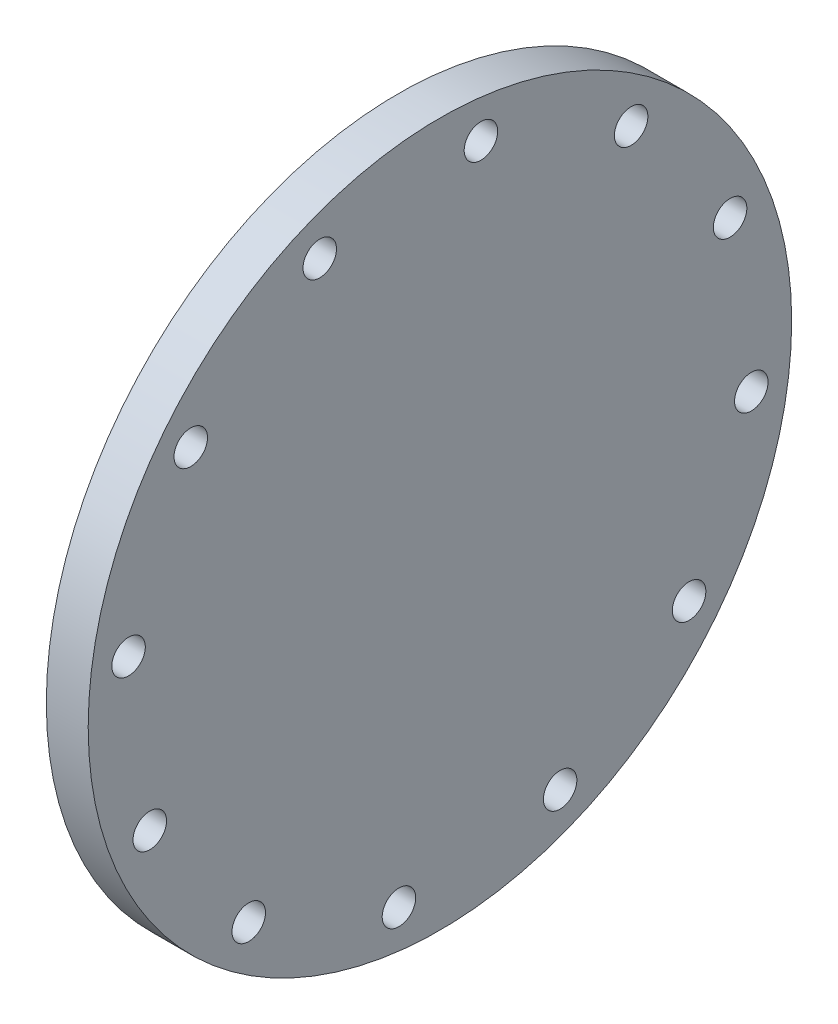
ISO-10303-21;
HEADER;
FILE_DESCRIPTION(('STEP AP214'),'2;1');
FILE_NAME('part.step','',(''),(''),'','','');
FILE_SCHEMA(('AUTOMOTIVE_DESIGN { 1 0 10303 214 1 1 1 1 }'));
ENDSEC;
DATA;
#1=APPLICATION_CONTEXT('core data for automotive mechanical design processes');
#2=APPLICATION_PROTOCOL_DEFINITION('international standard','automotive_design',2000,#1);
#3=PRODUCT_CONTEXT('',#1,'mechanical');
#4=PRODUCT('Part','Part','',(#3));
#5=PRODUCT_RELATED_PRODUCT_CATEGORY('part','',(#4));
#6=PRODUCT_DEFINITION_FORMATION('','',#4);
#7=PRODUCT_DEFINITION_CONTEXT('part definition',#1,'design');
#8=PRODUCT_DEFINITION('design','',#6,#7);
#9=PRODUCT_DEFINITION_SHAPE('','',#8);
#10=(LENGTH_UNIT() NAMED_UNIT(*) SI_UNIT(.MILLI.,.METRE.));
#11=(NAMED_UNIT(*) PLANE_ANGLE_UNIT() SI_UNIT($,.RADIAN.));
#12=(NAMED_UNIT(*) SI_UNIT($,.STERADIAN.) SOLID_ANGLE_UNIT());
#13=UNCERTAINTY_MEASURE_WITH_UNIT(LENGTH_MEASURE(1.E-05),#10,'distance_accuracy_value','');
#14=(GEOMETRIC_REPRESENTATION_CONTEXT(3) GLOBAL_UNCERTAINTY_ASSIGNED_CONTEXT((#13)) GLOBAL_UNIT_ASSIGNED_CONTEXT((#10,
#11,#12)) REPRESENTATION_CONTEXT('',''));
#15=CARTESIAN_POINT('',(0.,0.,0.));
#16=DIRECTION('',(0.,0.,1.));
#17=DIRECTION('',(1.,0.,0.));
#18=AXIS2_PLACEMENT_3D('',#15,#16,#17);
#19=CARTESIAN_POINT('',(0.,0.,0.));
#20=DIRECTION('',(-1.,0.,0.));
#21=DIRECTION('',(0.,0.,1.));
#22=AXIS2_PLACEMENT_3D('',#19,#20,#21);
#23=PLANE('',#22);
#24=CARTESIAN_POINT('',(0.,0.,0.));
#25=DIRECTION('',(-1.,0.,0.));
#26=DIRECTION('',(0.,0.,1.));
#27=AXIS2_PLACEMENT_3D('',#24,#25,#26);
#28=CIRCLE('',#27,206.375);
#29=CARTESIAN_POINT('',(0.,0.,206.375));
#30=VERTEX_POINT('',#29);
#31=EDGE_CURVE('E10',#30,#30,#28,.T.);
#32=ORIENTED_EDGE('',*,*,#31,.T.);
#33=EDGE_LOOP('',(#32));
#34=FACE_BOUND('',#33,.T.);
#35=ADVANCED_FACE('F30',(#34),#23,.T.);
#36=CARTESIAN_POINT('',(0.,0.,0.));
#37=DIRECTION('',(-1.,0.,0.));
#38=DIRECTION('',(0.,0.,1.));
#39=AXIS2_PLACEMENT_3D('',#36,#37,#38);
#40=CYLINDRICAL_SURFACE('',#39,206.375);
#41=CARTESIAN_POINT('',(1.5875,0.,0.));
#42=DIRECTION('',(-1.,0.,0.));
#43=DIRECTION('',(0.,0.,1.));
#44=AXIS2_PLACEMENT_3D('',#41,#42,#43);
#45=CIRCLE('',#44,206.375);
#46=CARTESIAN_POINT('',(1.5875,0.,206.375));
#47=VERTEX_POINT('',#46);
#48=EDGE_CURVE('E36',#47,#47,#45,.T.);
#49=ORIENTED_EDGE('',*,*,#48,.T.);
#50=EDGE_LOOP('',(#49));
#51=FACE_BOUND('',#50,.T.);
#52=ORIENTED_EDGE('',*,*,#31,.F.);
#53=EDGE_LOOP('',(#52));
#54=FACE_BOUND('',#53,.T.);
#55=ADVANCED_FACE('F162',(#51,#54),#40,.T.);
#56=CARTESIAN_POINT('',(1.5875,206.375,0.));
#57=DIRECTION('',(-1.,0.,0.));
#58=DIRECTION('',(0.,0.,1.));
#59=AXIS2_PLACEMENT_3D('',#56,#57,#58);
#60=PLANE('',#59);
#61=CARTESIAN_POINT('',(1.5875,236.087807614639,-31.0815495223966));
#62=DIRECTION('',(-1.,0.,0.));
#63=DIRECTION('',(0.,0.,1.));
#64=AXIS2_PLACEMENT_3D('',#61,#62,#63);
#65=CIRCLE('',#64,12.7);
#66=CARTESIAN_POINT('',(1.5875,236.087807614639,-18.3815495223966));
#67=VERTEX_POINT('',#66);
#68=EDGE_CURVE('E115',#67,#67,#65,.T.);
#69=ORIENTED_EDGE('',*,*,#68,.F.);
#70=EDGE_LOOP('',(#69));
#71=FACE_BOUND('',#70,.T.);
#72=CARTESIAN_POINT('',(1.5875,188.917264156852,-144.961315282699));
#73=DIRECTION('',(-1.,0.,0.));
#74=DIRECTION('',(0.,0.,1.));
#75=AXIS2_PLACEMENT_3D('',#72,#73,#74);
#76=CIRCLE('',#75,12.7);
#77=CARTESIAN_POINT('',(1.5875,188.917264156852,-132.261315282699));
#78=VERTEX_POINT('',#77);
#79=EDGE_CURVE('E109',#78,#78,#76,.T.);
#80=ORIENTED_EDGE('',*,*,#79,.F.);
#81=EDGE_LOOP('',(#80));
#82=FACE_BOUND('',#81,.T.);
#83=CARTESIAN_POINT('',(1.5875,91.1264923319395,-219.998813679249));
#84=DIRECTION('',(-1.,0.,0.));
#85=DIRECTION('',(0.,0.,1.));
#86=AXIS2_PLACEMENT_3D('',#83,#84,#85);
#87=CIRCLE('',#86,12.7);
#88=CARTESIAN_POINT('',(1.5875,91.1264923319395,-207.298813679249));
#89=VERTEX_POINT('',#88);
#90=EDGE_CURVE('E103',#89,#89,#87,.T.);
#91=ORIENTED_EDGE('',*,*,#90,.F.);
#92=EDGE_LOOP('',(#91));
#93=FACE_BOUND('',#92,.T.);
#94=CARTESIAN_POINT('',(1.5875,-31.0815495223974,-236.087807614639));
#95=DIRECTION('',(-1.,0.,0.));
#96=DIRECTION('',(0.,0.,1.));
#97=AXIS2_PLACEMENT_3D('',#94,#95,#96);
#98=CIRCLE('',#97,12.7);
#99=CARTESIAN_POINT('',(1.5875,-31.0815495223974,-223.387807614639));
#100=VERTEX_POINT('',#99);
#101=EDGE_CURVE('E97',#100,#100,#98,.T.);
#102=ORIENTED_EDGE('',*,*,#101,.F.);
#103=EDGE_LOOP('',(#102));
#104=FACE_BOUND('',#103,.T.);
#105=CARTESIAN_POINT('',(1.5875,-144.9613152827,-188.917264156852));
#106=DIRECTION('',(-1.,0.,0.));
#107=DIRECTION('',(0.,0.,1.));
#108=AXIS2_PLACEMENT_3D('',#105,#106,#107);
#109=CIRCLE('',#108,12.7);
#110=CARTESIAN_POINT('',(1.5875,-144.9613152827,-176.217264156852));
#111=VERTEX_POINT('',#110);
#112=EDGE_CURVE('E91',#111,#111,#109,.T.);
#113=ORIENTED_EDGE('',*,*,#112,.F.);
#114=EDGE_LOOP('',(#113));
#115=FACE_BOUND('',#114,.T.);
#116=CARTESIAN_POINT('',(1.5875,-219.998813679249,-91.1264923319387));
#117=DIRECTION('',(-1.,0.,0.));
#118=DIRECTION('',(0.,0.,1.));
#119=AXIS2_PLACEMENT_3D('',#116,#117,#118);
#120=CIRCLE('',#119,12.7);
#121=CARTESIAN_POINT('',(1.5875,-219.998813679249,-78.4264923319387));
#122=VERTEX_POINT('',#121);
#123=EDGE_CURVE('E85',#122,#122,#120,.T.);
#124=ORIENTED_EDGE('',*,*,#123,.F.);
#125=EDGE_LOOP('',(#124));
#126=FACE_BOUND('',#125,.T.);
#127=CARTESIAN_POINT('',(1.5875,-236.087807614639,31.0815495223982));
#128=DIRECTION('',(-1.,0.,0.));
#129=DIRECTION('',(0.,0.,1.));
#130=AXIS2_PLACEMENT_3D('',#127,#128,#129);
#131=CIRCLE('',#130,12.7);
#132=CARTESIAN_POINT('',(1.5875,-236.087807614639,43.7815495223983));
#133=VERTEX_POINT('',#132);
#134=EDGE_CURVE('E79',#133,#133,#131,.T.);
#135=ORIENTED_EDGE('',*,*,#134,.F.);
#136=EDGE_LOOP('',(#135));
#137=FACE_BOUND('',#136,.T.);
#138=CARTESIAN_POINT('',(1.5875,-188.917264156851,144.961315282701));
#139=DIRECTION('',(-1.,0.,0.));
#140=DIRECTION('',(0.,0.,1.));
#141=AXIS2_PLACEMENT_3D('',#138,#139,#140);
#142=CIRCLE('',#141,12.7);
#143=CARTESIAN_POINT('',(1.5875,-188.917264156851,157.661315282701));
#144=VERTEX_POINT('',#143);
#145=EDGE_CURVE('E73',#144,#144,#142,.T.);
#146=ORIENTED_EDGE('',*,*,#145,.F.);
#147=EDGE_LOOP('',(#146));
#148=FACE_BOUND('',#147,.T.);
#149=CARTESIAN_POINT('',(1.5875,-91.1264923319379,219.99881367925));
#150=DIRECTION('',(-1.,0.,0.));
#151=DIRECTION('',(0.,0.,1.));
#152=AXIS2_PLACEMENT_3D('',#149,#150,#151);
#153=CIRCLE('',#152,12.7);
#154=CARTESIAN_POINT('',(1.5875,-91.1264923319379,232.69881367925));
#155=VERTEX_POINT('',#154);
#156=EDGE_CURVE('E67',#155,#155,#153,.T.);
#157=ORIENTED_EDGE('',*,*,#156,.F.);
#158=EDGE_LOOP('',(#157));
#159=FACE_BOUND('',#158,.T.);
#160=CARTESIAN_POINT('',(1.5875,31.0815495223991,236.087807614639));
#161=DIRECTION('',(-1.,0.,0.));
#162=DIRECTION('',(0.,0.,1.));
#163=AXIS2_PLACEMENT_3D('',#160,#161,#162);
#164=CIRCLE('',#163,12.7);
#165=CARTESIAN_POINT('',(1.5875,31.0815495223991,248.787807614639));
#166=VERTEX_POINT('',#165);
#167=EDGE_CURVE('E61',#166,#166,#164,.T.);
#168=ORIENTED_EDGE('',*,*,#167,.F.);
#169=EDGE_LOOP('',(#168));
#170=FACE_BOUND('',#169,.T.);
#171=CARTESIAN_POINT('',(1.5875,144.961315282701,188.917264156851));
#172=DIRECTION('',(-1.,0.,0.));
#173=DIRECTION('',(0.,0.,1.));
#174=AXIS2_PLACEMENT_3D('',#171,#172,#173);
#175=CIRCLE('',#174,12.7);
#176=CARTESIAN_POINT('',(1.5875,144.961315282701,201.617264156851));
#177=VERTEX_POINT('',#176);
#178=EDGE_CURVE('E55',#177,#177,#175,.T.);
#179=ORIENTED_EDGE('',*,*,#178,.F.);
#180=EDGE_LOOP('',(#179));
#181=FACE_BOUND('',#180,.T.);
#182=CARTESIAN_POINT('',(1.5875,219.99881367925,91.1264923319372));
#183=DIRECTION('',(-1.,0.,0.));
#184=DIRECTION('',(0.,0.,1.));
#185=AXIS2_PLACEMENT_3D('',#182,#183,#184);
#186=CIRCLE('',#185,12.7);
#187=CARTESIAN_POINT('',(1.5875,219.99881367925,103.826492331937));
#188=VERTEX_POINT('',#187);
#189=EDGE_CURVE('E49',#188,#188,#186,.T.);
#190=ORIENTED_EDGE('',*,*,#189,.F.);
#191=EDGE_LOOP('',(#190));
#192=FACE_BOUND('',#191,.T.);
#193=CARTESIAN_POINT('',(1.5875,0.,0.));
#194=DIRECTION('',(-1.,0.,0.));
#195=DIRECTION('',(0.,0.,1.));
#196=AXIS2_PLACEMENT_3D('',#193,#194,#195);
#197=CIRCLE('',#196,266.7);
#198=CARTESIAN_POINT('',(1.5875,0.,266.7));
#199=VERTEX_POINT('',#198);
#200=EDGE_CURVE('E40',#199,#199,#197,.T.);
#201=ORIENTED_EDGE('',*,*,#200,.T.);
#202=EDGE_LOOP('',(#201));
#203=FACE_BOUND('',#202,.T.);
#204=ORIENTED_EDGE('',*,*,#48,.F.);
#205=EDGE_LOOP('',(#204));
#206=FACE_BOUND('',#205,.T.);
#207=ADVANCED_FACE('F156',(#71,#82,#93,#104,#115,#126,#137,#148,#159,#170,#181,#192,#203,#206),
#60,.T.);
#208=CARTESIAN_POINT('',(0.,0.,0.));
#209=DIRECTION('',(-1.,0.,0.));
#210=DIRECTION('',(0.,0.,1.));
#211=AXIS2_PLACEMENT_3D('',#208,#209,#210);
#212=CYLINDRICAL_SURFACE('',#211,266.7);
#213=CARTESIAN_POINT('',(33.3375,0.,0.));
#214=DIRECTION('',(-1.,0.,0.));
#215=DIRECTION('',(0.,0.,1.));
#216=AXIS2_PLACEMENT_3D('',#213,#214,#215);
#217=CIRCLE('',#216,266.7);
#218=CARTESIAN_POINT('',(33.3375,0.,266.7));
#219=VERTEX_POINT('',#218);
#220=EDGE_CURVE('E44',#219,#219,#217,.T.);
#221=ORIENTED_EDGE('',*,*,#220,.T.);
#222=EDGE_LOOP('',(#221));
#223=FACE_BOUND('',#222,.T.);
#224=ORIENTED_EDGE('',*,*,#200,.F.);
#225=EDGE_LOOP('',(#224));
#226=FACE_BOUND('',#225,.T.);
#227=ADVANCED_FACE('F128',(#223,#226),#212,.T.);
#228=CARTESIAN_POINT('',(33.3375,266.7,0.));
#229=DIRECTION('',(1.,0.,0.));
#230=DIRECTION('',(0.,0.,-1.));
#231=AXIS2_PLACEMENT_3D('',#228,#229,#230);
#232=PLANE('',#231);
#233=CARTESIAN_POINT('',(33.3375,236.087807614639,-31.0815495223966));
#234=DIRECTION('',(1.,0.,0.));
#235=DIRECTION('',(0.,-0.499999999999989,-0.866025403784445));
#236=AXIS2_PLACEMENT_3D('',#233,#234,#235);
#237=CIRCLE('',#236,12.7);
#238=CARTESIAN_POINT('',(33.3375,229.737807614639,-42.0800721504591));
#239=VERTEX_POINT('',#238);
#240=EDGE_CURVE('E118',#239,#239,#237,.T.);
#241=ORIENTED_EDGE('',*,*,#240,.F.);
#242=EDGE_LOOP('',(#241));
#243=FACE_BOUND('',#242,.T.);
#244=CARTESIAN_POINT('',(33.3375,188.917264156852,-144.961315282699));
#245=DIRECTION('',(1.,0.,0.));
#246=DIRECTION('',(0.,-0.866025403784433,-0.50000000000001));
#247=AXIS2_PLACEMENT_3D('',#244,#245,#246);
#248=CIRCLE('',#247,12.7);
#249=CARTESIAN_POINT('',(33.3375,177.91874152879,-151.311315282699));
#250=VERTEX_POINT('',#249);
#251=EDGE_CURVE('E112',#250,#250,#248,.T.);
#252=ORIENTED_EDGE('',*,*,#251,.F.);
#253=EDGE_LOOP('',(#252));
#254=FACE_BOUND('',#253,.T.);
#255=CARTESIAN_POINT('',(33.3375,91.1264923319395,-219.998813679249));
#256=DIRECTION('',(1.,0.,0.));
#257=DIRECTION('',(0.,-1.,0.));
#258=AXIS2_PLACEMENT_3D('',#255,#256,#257);
#259=CIRCLE('',#258,12.7);
#260=CARTESIAN_POINT('',(33.3375,78.4264923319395,-219.998813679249));
#261=VERTEX_POINT('',#260);
#262=EDGE_CURVE('E106',#261,#261,#259,.T.);
#263=ORIENTED_EDGE('',*,*,#262,.F.);
#264=EDGE_LOOP('',(#263));
#265=FACE_BOUND('',#264,.T.);
#266=CARTESIAN_POINT('',(33.3375,-31.0815495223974,-236.087807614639));
#267=DIRECTION('',(1.,0.,0.));
#268=DIRECTION('',(0.,-0.866025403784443,0.499999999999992));
#269=AXIS2_PLACEMENT_3D('',#266,#267,#268);
#270=CIRCLE('',#269,12.7);
#271=CARTESIAN_POINT('',(33.3375,-42.0800721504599,-229.737807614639));
#272=VERTEX_POINT('',#271);
#273=EDGE_CURVE('E100',#272,#272,#270,.T.);
#274=ORIENTED_EDGE('',*,*,#273,.F.);
#275=EDGE_LOOP('',(#274));
#276=FACE_BOUND('',#275,.T.);
#277=CARTESIAN_POINT('',(33.3375,-144.9613152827,-188.917264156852));
#278=DIRECTION('',(1.,0.,0.));
#279=DIRECTION('',(0.,-0.500000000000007,0.866025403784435));
#280=AXIS2_PLACEMENT_3D('',#277,#278,#279);
#281=CIRCLE('',#280,12.7);
#282=CARTESIAN_POINT('',(33.3375,-151.3113152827,-177.918741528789));
#283=VERTEX_POINT('',#282);
#284=EDGE_CURVE('E94',#283,#283,#281,.T.);
#285=ORIENTED_EDGE('',*,*,#284,.F.);
#286=EDGE_LOOP('',(#285));
#287=FACE_BOUND('',#286,.T.);
#288=CARTESIAN_POINT('',(33.3375,-219.998813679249,-91.1264923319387));
#289=DIRECTION('',(1.,0.,0.));
#290=DIRECTION('',(0.,0.,1.));
#291=AXIS2_PLACEMENT_3D('',#288,#289,#290);
#292=CIRCLE('',#291,12.7);
#293=CARTESIAN_POINT('',(33.3375,-219.99881367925,-78.4264923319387));
#294=VERTEX_POINT('',#293);
#295=EDGE_CURVE('E88',#294,#294,#292,.T.);
#296=ORIENTED_EDGE('',*,*,#295,.F.);
#297=EDGE_LOOP('',(#296));
#298=FACE_BOUND('',#297,.T.);
#299=CARTESIAN_POINT('',(33.3375,-236.087807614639,31.0815495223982));
#300=DIRECTION('',(1.,0.,0.));
#301=DIRECTION('',(0.,0.499999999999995,0.866025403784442));
#302=AXIS2_PLACEMENT_3D('',#299,#300,#301);
#303=CIRCLE('',#302,12.7);
#304=CARTESIAN_POINT('',(33.3375,-229.737807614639,42.0800721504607));
#305=VERTEX_POINT('',#304);
#306=EDGE_CURVE('E82',#305,#305,#303,.T.);
#307=ORIENTED_EDGE('',*,*,#306,.F.);
#308=EDGE_LOOP('',(#307));
#309=FACE_BOUND('',#308,.T.);
#310=CARTESIAN_POINT('',(33.3375,-188.917264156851,144.961315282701));
#311=DIRECTION('',(1.,0.,0.));
#312=DIRECTION('',(0.,0.866025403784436,0.500000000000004));
#313=AXIS2_PLACEMENT_3D('',#310,#311,#312);
#314=CIRCLE('',#313,12.7);
#315=CARTESIAN_POINT('',(33.3375,-177.918741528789,151.311315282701));
#316=VERTEX_POINT('',#315);
#317=EDGE_CURVE('E76',#316,#316,#314,.T.);
#318=ORIENTED_EDGE('',*,*,#317,.F.);
#319=EDGE_LOOP('',(#318));
#320=FACE_BOUND('',#319,.T.);
#321=CARTESIAN_POINT('',(33.3375,-91.1264923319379,219.99881367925));
#322=DIRECTION('',(1.,0.,0.));
#323=DIRECTION('',(0.,1.,0.));
#324=AXIS2_PLACEMENT_3D('',#321,#322,#323);
#325=CIRCLE('',#324,12.7);
#326=CARTESIAN_POINT('',(33.3375,-78.4264923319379,219.99881367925));
#327=VERTEX_POINT('',#326);
#328=EDGE_CURVE('E70',#327,#327,#325,.T.);
#329=ORIENTED_EDGE('',*,*,#328,.F.);
#330=EDGE_LOOP('',(#329));
#331=FACE_BOUND('',#330,.T.);
#332=CARTESIAN_POINT('',(33.3375,31.0815495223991,236.087807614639));
#333=DIRECTION('',(1.,0.,0.));
#334=DIRECTION('',(0.,0.86602540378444,-0.499999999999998));
#335=AXIS2_PLACEMENT_3D('',#332,#333,#334);
#336=CIRCLE('',#335,12.7);
#337=CARTESIAN_POINT('',(33.3375,42.0800721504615,229.737807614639));
#338=VERTEX_POINT('',#337);
#339=EDGE_CURVE('E64',#338,#338,#336,.T.);
#340=ORIENTED_EDGE('',*,*,#339,.F.);
#341=EDGE_LOOP('',(#340));
#342=FACE_BOUND('',#341,.T.);
#343=CARTESIAN_POINT('',(33.3375,144.961315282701,188.917264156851));
#344=DIRECTION('',(1.,0.,0.));
#345=DIRECTION('',(0.,0.500000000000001,-0.866025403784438));
#346=AXIS2_PLACEMENT_3D('',#343,#344,#345);
#347=CIRCLE('',#346,12.7);
#348=CARTESIAN_POINT('',(33.3375,151.311315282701,177.918741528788));
#349=VERTEX_POINT('',#348);
#350=EDGE_CURVE('E58',#349,#349,#347,.T.);
#351=ORIENTED_EDGE('',*,*,#350,.F.);
#352=EDGE_LOOP('',(#351));
#353=FACE_BOUND('',#352,.T.);
#354=CARTESIAN_POINT('',(33.3375,219.99881367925,91.1264923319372));
#355=DIRECTION('',(1.,0.,0.));
#356=DIRECTION('',(0.,0.,-1.));
#357=AXIS2_PLACEMENT_3D('',#354,#355,#356);
#358=CIRCLE('',#357,12.7);
#359=CARTESIAN_POINT('',(33.3375,219.99881367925,78.4264923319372));
#360=VERTEX_POINT('',#359);
#361=EDGE_CURVE('E52',#360,#360,#358,.T.);
#362=ORIENTED_EDGE('',*,*,#361,.F.);
#363=EDGE_LOOP('',(#362));
#364=FACE_BOUND('',#363,.T.);
#365=ORIENTED_EDGE('',*,*,#220,.F.);
#366=EDGE_LOOP('',(#365));
#367=FACE_BOUND('',#366,.T.);
#368=ADVANCED_FACE('F124',(#243,#254,#265,#276,#287,#298,#309,#320,#331,#342,#353,#364,#367),
#232,.T.);
#369=CARTESIAN_POINT('',(0.,219.99881367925,91.1264923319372));
#370=DIRECTION('',(1.,0.,0.));
#371=DIRECTION('',(0.,0.,-1.));
#372=AXIS2_PLACEMENT_3D('',#369,#370,#371);
#373=CYLINDRICAL_SURFACE('',#372,12.7);
#374=ORIENTED_EDGE('',*,*,#189,.T.);
#375=EDGE_LOOP('',(#374));
#376=FACE_BOUND('',#375,.T.);
#377=ORIENTED_EDGE('',*,*,#361,.T.);
#378=EDGE_LOOP('',(#377));
#379=FACE_BOUND('',#378,.T.);
#380=ADVANCED_FACE('F127',(#376,#379),#373,.F.);
#381=CARTESIAN_POINT('',(0.,144.961315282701,188.917264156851));
#382=DIRECTION('',(1.,0.,0.));
#383=DIRECTION('',(0.,0.,-1.));
#384=AXIS2_PLACEMENT_3D('',#381,#382,#383);
#385=CYLINDRICAL_SURFACE('',#384,12.7);
#386=ORIENTED_EDGE('',*,*,#178,.T.);
#387=EDGE_LOOP('',(#386));
#388=FACE_BOUND('',#387,.T.);
#389=ORIENTED_EDGE('',*,*,#350,.T.);
#390=EDGE_LOOP('',(#389));
#391=FACE_BOUND('',#390,.T.);
#392=ADVANCED_FACE('F193',(#388,#391),#385,.F.);
#393=CARTESIAN_POINT('',(0.,31.0815495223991,236.087807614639));
#394=DIRECTION('',(1.,0.,0.));
#395=DIRECTION('',(0.,0.,-1.));
#396=AXIS2_PLACEMENT_3D('',#393,#394,#395);
#397=CYLINDRICAL_SURFACE('',#396,12.7);
#398=ORIENTED_EDGE('',*,*,#167,.T.);
#399=EDGE_LOOP('',(#398));
#400=FACE_BOUND('',#399,.T.);
#401=ORIENTED_EDGE('',*,*,#339,.T.);
#402=EDGE_LOOP('',(#401));
#403=FACE_BOUND('',#402,.T.);
#404=ADVANCED_FACE('F212',(#400,#403),#397,.F.);
#405=CARTESIAN_POINT('',(0.,-91.1264923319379,219.99881367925));
#406=DIRECTION('',(1.,0.,0.));
#407=DIRECTION('',(0.,0.,-1.));
#408=AXIS2_PLACEMENT_3D('',#405,#406,#407);
#409=CYLINDRICAL_SURFACE('',#408,12.7);
#410=ORIENTED_EDGE('',*,*,#156,.T.);
#411=EDGE_LOOP('',(#410));
#412=FACE_BOUND('',#411,.T.);
#413=ORIENTED_EDGE('',*,*,#328,.T.);
#414=EDGE_LOOP('',(#413));
#415=FACE_BOUND('',#414,.T.);
#416=ADVANCED_FACE('F222',(#412,#415),#409,.F.);
#417=CARTESIAN_POINT('',(0.,-188.917264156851,144.961315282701));
#418=DIRECTION('',(1.,0.,0.));
#419=DIRECTION('',(0.,0.,-1.));
#420=AXIS2_PLACEMENT_3D('',#417,#418,#419);
#421=CYLINDRICAL_SURFACE('',#420,12.7);
#422=ORIENTED_EDGE('',*,*,#145,.T.);
#423=EDGE_LOOP('',(#422));
#424=FACE_BOUND('',#423,.T.);
#425=ORIENTED_EDGE('',*,*,#317,.T.);
#426=EDGE_LOOP('',(#425));
#427=FACE_BOUND('',#426,.T.);
#428=ADVANCED_FACE('F232',(#424,#427),#421,.F.);
#429=CARTESIAN_POINT('',(0.,-236.087807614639,31.0815495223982));
#430=DIRECTION('',(1.,0.,0.));
#431=DIRECTION('',(0.,0.,-1.));
#432=AXIS2_PLACEMENT_3D('',#429,#430,#431);
#433=CYLINDRICAL_SURFACE('',#432,12.7);
#434=ORIENTED_EDGE('',*,*,#134,.T.);
#435=EDGE_LOOP('',(#434));
#436=FACE_BOUND('',#435,.T.);
#437=ORIENTED_EDGE('',*,*,#306,.T.);
#438=EDGE_LOOP('',(#437));
#439=FACE_BOUND('',#438,.T.);
#440=ADVANCED_FACE('F242',(#436,#439),#433,.F.);
#441=CARTESIAN_POINT('',(0.,-219.998813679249,-91.1264923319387));
#442=DIRECTION('',(1.,0.,0.));
#443=DIRECTION('',(0.,0.,-1.));
#444=AXIS2_PLACEMENT_3D('',#441,#442,#443);
#445=CYLINDRICAL_SURFACE('',#444,12.7);
#446=ORIENTED_EDGE('',*,*,#123,.T.);
#447=EDGE_LOOP('',(#446));
#448=FACE_BOUND('',#447,.T.);
#449=ORIENTED_EDGE('',*,*,#295,.T.);
#450=EDGE_LOOP('',(#449));
#451=FACE_BOUND('',#450,.T.);
#452=ADVANCED_FACE('F252',(#448,#451),#445,.F.);
#453=CARTESIAN_POINT('',(0.,-144.9613152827,-188.917264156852));
#454=DIRECTION('',(1.,0.,0.));
#455=DIRECTION('',(0.,0.,-1.));
#456=AXIS2_PLACEMENT_3D('',#453,#454,#455);
#457=CYLINDRICAL_SURFACE('',#456,12.7);
#458=ORIENTED_EDGE('',*,*,#112,.T.);
#459=EDGE_LOOP('',(#458));
#460=FACE_BOUND('',#459,.T.);
#461=ORIENTED_EDGE('',*,*,#284,.T.);
#462=EDGE_LOOP('',(#461));
#463=FACE_BOUND('',#462,.T.);
#464=ADVANCED_FACE('F262',(#460,#463),#457,.F.);
#465=CARTESIAN_POINT('',(0.,-31.0815495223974,-236.087807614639));
#466=DIRECTION('',(1.,0.,0.));
#467=DIRECTION('',(0.,0.,-1.));
#468=AXIS2_PLACEMENT_3D('',#465,#466,#467);
#469=CYLINDRICAL_SURFACE('',#468,12.7);
#470=ORIENTED_EDGE('',*,*,#101,.T.);
#471=EDGE_LOOP('',(#470));
#472=FACE_BOUND('',#471,.T.);
#473=ORIENTED_EDGE('',*,*,#273,.T.);
#474=EDGE_LOOP('',(#473));
#475=FACE_BOUND('',#474,.T.);
#476=ADVANCED_FACE('F272',(#472,#475),#469,.F.);
#477=CARTESIAN_POINT('',(0.,91.1264923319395,-219.998813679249));
#478=DIRECTION('',(1.,0.,0.));
#479=DIRECTION('',(0.,0.,-1.));
#480=AXIS2_PLACEMENT_3D('',#477,#478,#479);
#481=CYLINDRICAL_SURFACE('',#480,12.7);
#482=ORIENTED_EDGE('',*,*,#90,.T.);
#483=EDGE_LOOP('',(#482));
#484=FACE_BOUND('',#483,.T.);
#485=ORIENTED_EDGE('',*,*,#262,.T.);
#486=EDGE_LOOP('',(#485));
#487=FACE_BOUND('',#486,.T.);
#488=ADVANCED_FACE('F282',(#484,#487),#481,.F.);
#489=CARTESIAN_POINT('',(0.,188.917264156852,-144.961315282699));
#490=DIRECTION('',(1.,0.,0.));
#491=DIRECTION('',(0.,0.,-1.));
#492=AXIS2_PLACEMENT_3D('',#489,#490,#491);
#493=CYLINDRICAL_SURFACE('',#492,12.7);
#494=ORIENTED_EDGE('',*,*,#79,.T.);
#495=EDGE_LOOP('',(#494));
#496=FACE_BOUND('',#495,.T.);
#497=ORIENTED_EDGE('',*,*,#251,.T.);
#498=EDGE_LOOP('',(#497));
#499=FACE_BOUND('',#498,.T.);
#500=ADVANCED_FACE('F292',(#496,#499),#493,.F.);
#501=CARTESIAN_POINT('',(0.,236.087807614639,-31.0815495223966));
#502=DIRECTION('',(1.,0.,0.));
#503=DIRECTION('',(0.,0.,-1.));
#504=AXIS2_PLACEMENT_3D('',#501,#502,#503);
#505=CYLINDRICAL_SURFACE('',#504,12.7);
#506=ORIENTED_EDGE('',*,*,#68,.T.);
#507=EDGE_LOOP('',(#506));
#508=FACE_BOUND('',#507,.T.);
#509=ORIENTED_EDGE('',*,*,#240,.T.);
#510=EDGE_LOOP('',(#509));
#511=FACE_BOUND('',#510,.T.);
#512=ADVANCED_FACE('F122',(#508,#511),#505,.F.);
#513=CLOSED_SHELL('',(#35,#55,#207,#227,#368,#380,#392,#404,#416,#428,#440,#452,#464,#476,#488,
#500,#512));
#514=MANIFOLD_SOLID_BREP('B2',#513);
#515=ADVANCED_BREP_SHAPE_REPRESENTATION('',(#18,#514),#14);
#516=SHAPE_DEFINITION_REPRESENTATION(#9,#515);
ENDSEC;
END-ISO-10303-21;
